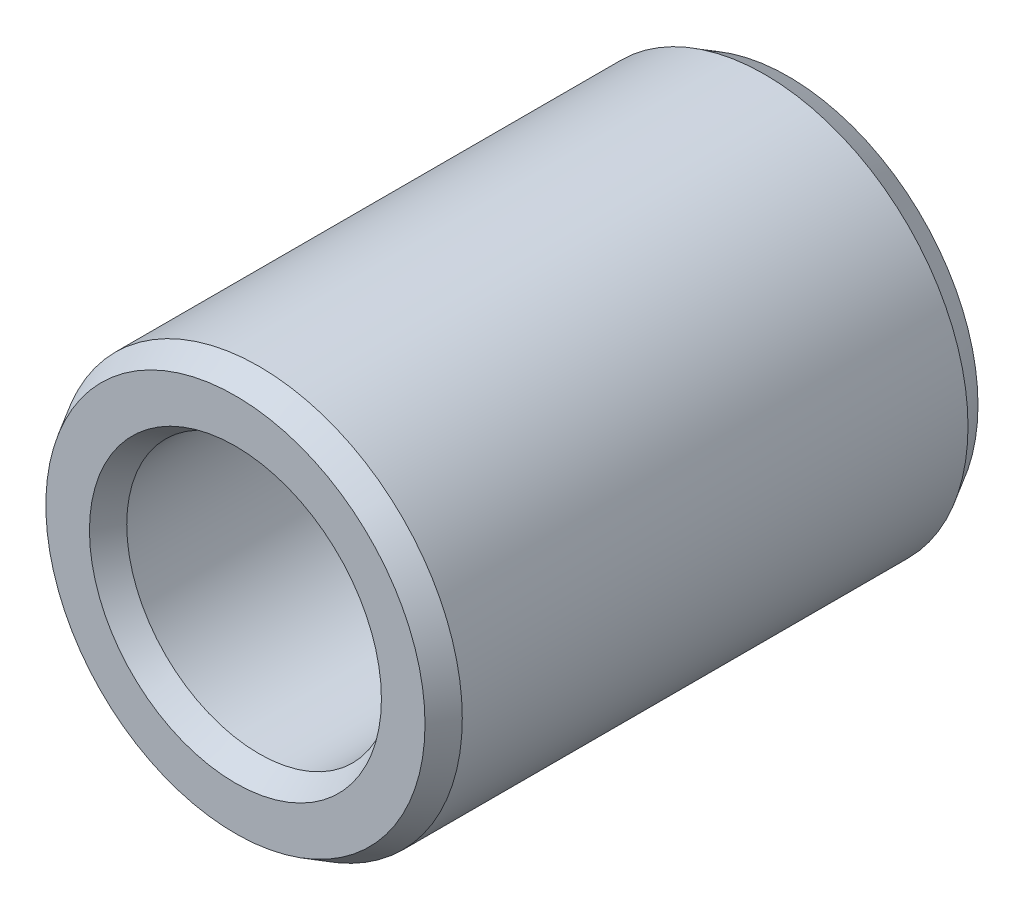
ISO-10303-21;
HEADER;
FILE_DESCRIPTION(('STEP AP214'),'2;1');
FILE_NAME('part.step','',(''),(''),'','','');
FILE_SCHEMA(('AUTOMOTIVE_DESIGN { 1 0 10303 214 1 1 1 1 }'));
ENDSEC;
DATA;
#1=APPLICATION_CONTEXT('core data for automotive mechanical design processes');
#2=APPLICATION_PROTOCOL_DEFINITION('international standard','automotive_design',2000,#1);
#3=PRODUCT_CONTEXT('',#1,'mechanical');
#4=PRODUCT('Part','Part','',(#3));
#5=PRODUCT_RELATED_PRODUCT_CATEGORY('part','',(#4));
#6=PRODUCT_DEFINITION_FORMATION('','',#4);
#7=PRODUCT_DEFINITION_CONTEXT('part definition',#1,'design');
#8=PRODUCT_DEFINITION('design','',#6,#7);
#9=PRODUCT_DEFINITION_SHAPE('','',#8);
#10=(LENGTH_UNIT() NAMED_UNIT(*) SI_UNIT(.MILLI.,.METRE.));
#11=(NAMED_UNIT(*) PLANE_ANGLE_UNIT() SI_UNIT($,.RADIAN.));
#12=(NAMED_UNIT(*) SI_UNIT($,.STERADIAN.) SOLID_ANGLE_UNIT());
#13=UNCERTAINTY_MEASURE_WITH_UNIT(LENGTH_MEASURE(1.E-05),#10,'distance_accuracy_value','');
#14=(GEOMETRIC_REPRESENTATION_CONTEXT(3) GLOBAL_UNCERTAINTY_ASSIGNED_CONTEXT((#13)) GLOBAL_UNIT_ASSIGNED_CONTEXT((#10,
#11,#12)) REPRESENTATION_CONTEXT('',''));
#15=CARTESIAN_POINT('',(0.,0.,0.));
#16=DIRECTION('',(0.,0.,1.));
#17=DIRECTION('',(1.,0.,0.));
#18=AXIS2_PLACEMENT_3D('',#15,#16,#17);
#19=CARTESIAN_POINT('',(0.,0.,5.9436));
#20=DIRECTION('',(0.,0.,1.));
#21=DIRECTION('',(1.,0.,0.));
#22=AXIS2_PLACEMENT_3D('',#19,#20,#21);
#23=PLANE('',#22);
#24=CARTESIAN_POINT('',(0.,0.,5.9436));
#25=DIRECTION('',(0.,0.,1.));
#26=DIRECTION('',(1.,0.,0.));
#27=AXIS2_PLACEMENT_3D('',#24,#25,#26);
#28=CIRCLE('',#27,1.56904696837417);
#29=CARTESIAN_POINT('',(1.56904696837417,0.,5.9436));
#30=VERTEX_POINT('',#29);
#31=EDGE_CURVE('E41',#30,#30,#28,.F.);
#32=ORIENTED_EDGE('',*,*,#31,.T.);
#33=EDGE_LOOP('',(#32));
#34=FACE_BOUND('',#33,.T.);
#35=CARTESIAN_POINT('',(0.,0.,5.9436));
#36=DIRECTION('',(0.,0.,1.));
#37=DIRECTION('',(1.,0.,0.));
#38=AXIS2_PLACEMENT_3D('',#35,#36,#37);
#39=CIRCLE('',#38,2.03775303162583);
#40=CARTESIAN_POINT('',(2.03775303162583,0.,5.9436));
#41=VERTEX_POINT('',#40);
#42=EDGE_CURVE('E45',#41,#41,#39,.T.);
#43=ORIENTED_EDGE('',*,*,#42,.T.);
#44=EDGE_LOOP('',(#43));
#45=FACE_BOUND('',#44,.T.);
#46=ADVANCED_FACE('F30',(#34,#45),#23,.T.);
#47=CARTESIAN_POINT('',(0.,0.,0.));
#48=DIRECTION('',(0.,0.,1.));
#49=DIRECTION('',(1.,0.,0.));
#50=AXIS2_PLACEMENT_3D('',#47,#48,#49);
#51=PLANE('',#50);
#52=CARTESIAN_POINT('',(0.,0.,0.));
#53=DIRECTION('',(0.,0.,1.));
#54=DIRECTION('',(1.,0.,0.));
#55=AXIS2_PLACEMENT_3D('',#52,#53,#54);
#56=CIRCLE('',#55,1.56904696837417);
#57=CARTESIAN_POINT('',(1.56904696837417,0.,0.));
#58=VERTEX_POINT('',#57);
#59=EDGE_CURVE('E56',#58,#58,#56,.T.);
#60=ORIENTED_EDGE('',*,*,#59,.T.);
#61=EDGE_LOOP('',(#60));
#62=FACE_BOUND('',#61,.T.);
#63=CARTESIAN_POINT('',(0.,0.,0.));
#64=DIRECTION('',(0.,0.,1.));
#65=DIRECTION('',(1.,0.,0.));
#66=AXIS2_PLACEMENT_3D('',#63,#64,#65);
#67=CIRCLE('',#66,2.03775303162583);
#68=CARTESIAN_POINT('',(2.03775303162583,0.,0.));
#69=VERTEX_POINT('',#68);
#70=EDGE_CURVE('E59',#69,#69,#67,.F.);
#71=ORIENTED_EDGE('',*,*,#70,.T.);
#72=EDGE_LOOP('',(#71));
#73=FACE_BOUND('',#72,.T.);
#74=ADVANCED_FACE('F63',(#62,#73),#51,.F.);
#75=CARTESIAN_POINT('',(0.,0.,5.9436));
#76=DIRECTION('',(0.,0.,-1.));
#77=DIRECTION('',(-1.,0.,0.));
#78=AXIS2_PLACEMENT_3D('',#75,#76,#77);
#79=CYLINDRICAL_SURFACE('',#78,2.1844);
#80=CARTESIAN_POINT('',(0.,0.,0.254000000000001));
#81=DIRECTION('',(0.,0.,1.));
#82=DIRECTION('',(1.,0.,0.));
#83=AXIS2_PLACEMENT_3D('',#80,#81,#82);
#84=CIRCLE('',#83,2.1844);
#85=CARTESIAN_POINT('',(2.1844,0.,0.254000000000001));
#86=VERTEX_POINT('',#85);
#87=EDGE_CURVE('E10',#86,#86,#84,.T.);
#88=ORIENTED_EDGE('',*,*,#87,.T.);
#89=EDGE_LOOP('',(#88));
#90=FACE_BOUND('',#89,.T.);
#91=CARTESIAN_POINT('',(0.,0.,5.6896));
#92=DIRECTION('',(0.,0.,1.));
#93=DIRECTION('',(1.,0.,0.));
#94=AXIS2_PLACEMENT_3D('',#91,#92,#93);
#95=CIRCLE('',#94,2.1844);
#96=CARTESIAN_POINT('',(2.1844,0.,5.6896));
#97=VERTEX_POINT('',#96);
#98=EDGE_CURVE('E37',#97,#97,#95,.F.);
#99=ORIENTED_EDGE('',*,*,#98,.T.);
#100=EDGE_LOOP('',(#99));
#101=FACE_BOUND('',#100,.T.);
#102=ADVANCED_FACE('F32',(#90,#101),#79,.T.);
#103=CARTESIAN_POINT('',(0.,0.,5.9436));
#104=DIRECTION('',(0.,0.,-1.));
#105=DIRECTION('',(-1.,0.,0.));
#106=AXIS2_PLACEMENT_3D('',#103,#104,#105);
#107=CYLINDRICAL_SURFACE('',#106,1.4224);
#108=CARTESIAN_POINT('',(0.,0.,0.254000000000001));
#109=DIRECTION('',(0.,0.,1.));
#110=DIRECTION('',(1.,0.,0.));
#111=AXIS2_PLACEMENT_3D('',#108,#109,#110);
#112=CIRCLE('',#111,1.4224);
#113=CARTESIAN_POINT('',(1.4224,0.,0.254000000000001));
#114=VERTEX_POINT('',#113);
#115=EDGE_CURVE('E50',#114,#114,#112,.F.);
#116=ORIENTED_EDGE('',*,*,#115,.T.);
#117=EDGE_LOOP('',(#116));
#118=FACE_BOUND('',#117,.T.);
#119=CARTESIAN_POINT('',(0.,0.,5.6896));
#120=DIRECTION('',(0.,0.,1.));
#121=DIRECTION('',(1.,0.,0.));
#122=AXIS2_PLACEMENT_3D('',#119,#120,#121);
#123=CIRCLE('',#122,1.4224);
#124=CARTESIAN_POINT('',(1.4224,0.,5.6896));
#125=VERTEX_POINT('',#124);
#126=EDGE_CURVE('E53',#125,#125,#123,.T.);
#127=ORIENTED_EDGE('',*,*,#126,.T.);
#128=EDGE_LOOP('',(#127));
#129=FACE_BOUND('',#128,.T.);
#130=ADVANCED_FACE('F89',(#118,#129),#107,.F.);
#131=CARTESIAN_POINT('',(0.,0.,0.));
#132=DIRECTION('',(0.,0.,-1.));
#133=DIRECTION('',(-1.,0.,0.));
#134=AXIS2_PLACEMENT_3D('',#131,#132,#133);
#135=CONICAL_SURFACE('',#134,1.56904696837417,0.523598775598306);
#136=ORIENTED_EDGE('',*,*,#115,.F.);
#137=EDGE_LOOP('',(#136));
#138=FACE_BOUND('',#137,.T.);
#139=ORIENTED_EDGE('',*,*,#59,.F.);
#140=EDGE_LOOP('',(#139));
#141=FACE_BOUND('',#140,.T.);
#142=ADVANCED_FACE('F77',(#138,#141),#135,.F.);
#143=CARTESIAN_POINT('',(0.,0.,5.6896));
#144=DIRECTION('',(0.,0.,1.));
#145=DIRECTION('',(1.,0.,0.));
#146=AXIS2_PLACEMENT_3D('',#143,#144,#145);
#147=CONICAL_SURFACE('',#146,1.4224,0.523598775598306);
#148=ORIENTED_EDGE('',*,*,#31,.F.);
#149=EDGE_LOOP('',(#148));
#150=FACE_BOUND('',#149,.T.);
#151=ORIENTED_EDGE('',*,*,#126,.F.);
#152=EDGE_LOOP('',(#151));
#153=FACE_BOUND('',#152,.T.);
#154=ADVANCED_FACE('F69',(#150,#153),#147,.F.);
#155=CARTESIAN_POINT('',(0.,0.,0.254000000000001));
#156=DIRECTION('',(0.,0.,1.));
#157=DIRECTION('',(1.,0.,0.));
#158=AXIS2_PLACEMENT_3D('',#155,#156,#157);
#159=CONICAL_SURFACE('',#158,2.1844,0.523598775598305);
#160=ORIENTED_EDGE('',*,*,#70,.F.);
#161=EDGE_LOOP('',(#160));
#162=FACE_BOUND('',#161,.T.);
#163=ORIENTED_EDGE('',*,*,#87,.F.);
#164=EDGE_LOOP('',(#163));
#165=FACE_BOUND('',#164,.T.);
#166=ADVANCED_FACE('F65',(#162,#165),#159,.T.);
#167=CARTESIAN_POINT('',(0.,0.,5.9436));
#168=DIRECTION('',(0.,0.,-1.));
#169=DIRECTION('',(-1.,0.,0.));
#170=AXIS2_PLACEMENT_3D('',#167,#168,#169);
#171=CONICAL_SURFACE('',#170,2.03775303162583,0.523598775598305);
#172=ORIENTED_EDGE('',*,*,#98,.F.);
#173=EDGE_LOOP('',(#172));
#174=FACE_BOUND('',#173,.T.);
#175=ORIENTED_EDGE('',*,*,#42,.F.);
#176=EDGE_LOOP('',(#175));
#177=FACE_BOUND('',#176,.T.);
#178=ADVANCED_FACE('F68',(#174,#177),#171,.T.);
#179=CLOSED_SHELL('',(#46,#74,#102,#130,#142,#154,#166,#178));
#180=MANIFOLD_SOLID_BREP('B2',#179);
#181=ADVANCED_BREP_SHAPE_REPRESENTATION('',(#18,#180),#14);
#182=SHAPE_DEFINITION_REPRESENTATION(#9,#181);
ENDSEC;
END-ISO-10303-21;
